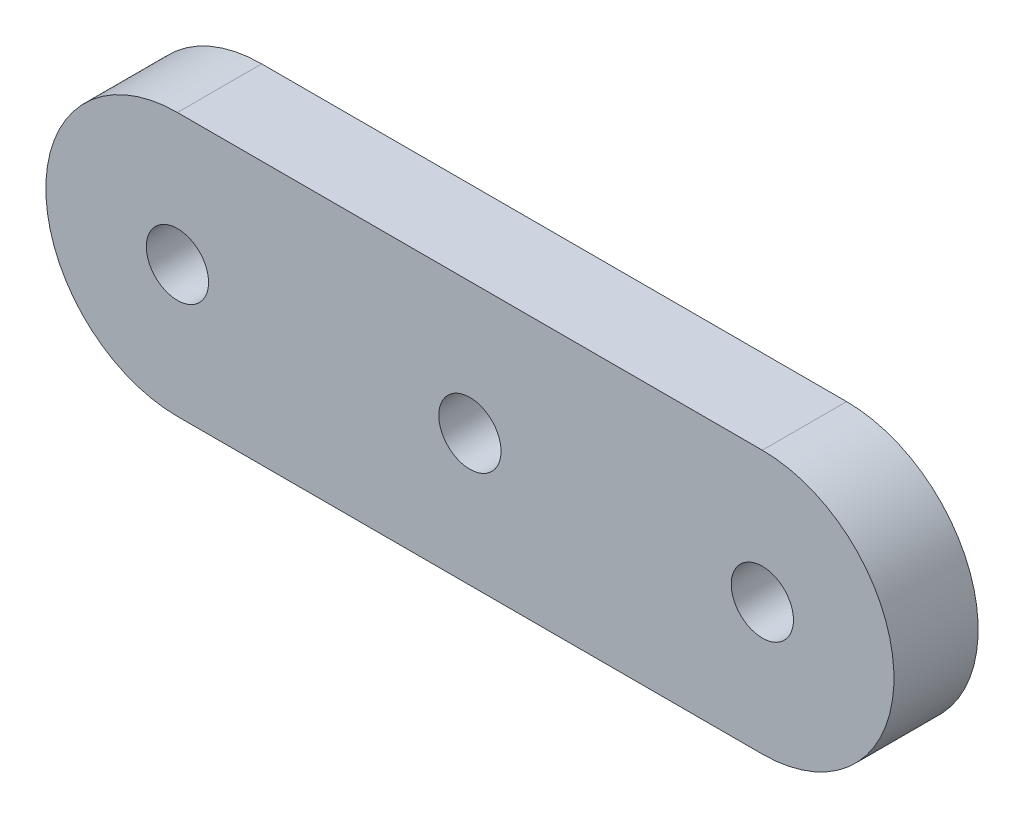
ISO-10303-21;
HEADER;
FILE_DESCRIPTION(('STEP AP214'),'2;1');
FILE_NAME('part.step','',(''),(''),'','','');
FILE_SCHEMA(('AUTOMOTIVE_DESIGN { 1 0 10303 214 1 1 1 1 }'));
ENDSEC;
DATA;
#1=APPLICATION_CONTEXT('core data for automotive mechanical design processes');
#2=APPLICATION_PROTOCOL_DEFINITION('international standard','automotive_design',2000,#1);
#3=PRODUCT_CONTEXT('',#1,'mechanical');
#4=PRODUCT('Part','Part','',(#3));
#5=PRODUCT_RELATED_PRODUCT_CATEGORY('part','',(#4));
#6=PRODUCT_DEFINITION_FORMATION('','',#4);
#7=PRODUCT_DEFINITION_CONTEXT('part definition',#1,'design');
#8=PRODUCT_DEFINITION('design','',#6,#7);
#9=PRODUCT_DEFINITION_SHAPE('','',#8);
#10=(LENGTH_UNIT() NAMED_UNIT(*) SI_UNIT(.MILLI.,.METRE.));
#11=(NAMED_UNIT(*) PLANE_ANGLE_UNIT() SI_UNIT($,.RADIAN.));
#12=(NAMED_UNIT(*) SI_UNIT($,.STERADIAN.) SOLID_ANGLE_UNIT());
#13=UNCERTAINTY_MEASURE_WITH_UNIT(LENGTH_MEASURE(1.E-05),#10,'distance_accuracy_value','');
#14=(GEOMETRIC_REPRESENTATION_CONTEXT(3) GLOBAL_UNCERTAINTY_ASSIGNED_CONTEXT((#13)) GLOBAL_UNIT_ASSIGNED_CONTEXT((#10,
#11,#12)) REPRESENTATION_CONTEXT('',''));
#15=CARTESIAN_POINT('',(0.,0.,0.));
#16=DIRECTION('',(0.,0.,1.));
#17=DIRECTION('',(1.,0.,0.));
#18=AXIS2_PLACEMENT_3D('',#15,#16,#17);
#19=CARTESIAN_POINT('',(-15.875,0.,4.572));
#20=DIRECTION('',(0.,0.,1.));
#21=DIRECTION('',(1.,0.,0.));
#22=AXIS2_PLACEMENT_3D('',#19,#20,#21);
#23=PLANE('',#22);
#24=CARTESIAN_POINT('',(15.875,0.,4.572));
#25=DIRECTION('',(0.,0.,1.));
#26=DIRECTION('',(1.,0.,0.));
#27=AXIS2_PLACEMENT_3D('',#24,#25,#26);
#28=CIRCLE('',#27,3.3782);
#29=CARTESIAN_POINT('',(19.2532,0.,4.572));
#30=VERTEX_POINT('',#29);
#31=EDGE_CURVE('E86',#30,#30,#28,.T.);
#32=ORIENTED_EDGE('',*,*,#31,.F.);
#33=EDGE_LOOP('',(#32));
#34=FACE_BOUND('',#33,.T.);
#35=CARTESIAN_POINT('',(-15.875,0.,4.572));
#36=DIRECTION('',(0.,0.,1.));
#37=DIRECTION('',(1.,0.,0.));
#38=AXIS2_PLACEMENT_3D('',#35,#36,#37);
#39=CIRCLE('',#38,3.3782);
#40=CARTESIAN_POINT('',(-12.4968,0.,4.572));
#41=VERTEX_POINT('',#40);
#42=EDGE_CURVE('E90',#41,#41,#39,.T.);
#43=ORIENTED_EDGE('',*,*,#42,.F.);
#44=EDGE_LOOP('',(#43));
#45=FACE_BOUND('',#44,.T.);
#46=CARTESIAN_POINT('',(-15.875,0.,4.572));
#47=DIRECTION('',(0.,0.,1.));
#48=DIRECTION('',(1.,0.,0.));
#49=AXIS2_PLACEMENT_3D('',#46,#47,#48);
#50=CIRCLE('',#49,14.2875);
#51=CARTESIAN_POINT('',(-15.875,14.2875,4.572));
#52=VERTEX_POINT('',#51);
#53=CARTESIAN_POINT('',(-15.875,-14.2875,4.572));
#54=VERTEX_POINT('',#53);
#55=EDGE_CURVE('E59',#52,#54,#50,.T.);
#56=ORIENTED_EDGE('',*,*,#55,.T.);
#57=DIRECTION('',(1.,0.,0.));
#58=VECTOR('',#57,1.);
#59=CARTESIAN_POINT('',(-15.875,-14.2875,4.572));
#60=LINE('',#59,#58);
#61=CARTESIAN_POINT('',(47.625,-14.2875,4.572));
#62=VERTEX_POINT('',#61);
#63=EDGE_CURVE('E53',#54,#62,#60,.T.);
#64=ORIENTED_EDGE('',*,*,#63,.T.);
#65=CARTESIAN_POINT('',(47.625,0.,4.572));
#66=DIRECTION('',(0.,0.,1.));
#67=DIRECTION('',(-1.,0.,0.));
#68=AXIS2_PLACEMENT_3D('',#65,#66,#67);
#69=CIRCLE('',#68,14.2875);
#70=CARTESIAN_POINT('',(47.625,14.2875,4.572));
#71=VERTEX_POINT('',#70);
#72=EDGE_CURVE('E57',#62,#71,#69,.T.);
#73=ORIENTED_EDGE('',*,*,#72,.T.);
#74=DIRECTION('',(-1.,0.,0.));
#75=VECTOR('',#74,1.);
#76=CARTESIAN_POINT('',(15.875,14.2875,4.572));
#77=LINE('',#76,#75);
#78=EDGE_CURVE('E33',#71,#52,#77,.T.);
#79=ORIENTED_EDGE('',*,*,#78,.T.);
#80=EDGE_LOOP('',(#56,#64,#73,#79));
#81=FACE_BOUND('',#80,.T.);
#82=CARTESIAN_POINT('',(47.625,0.,4.572));
#83=DIRECTION('',(0.,0.,1.));
#84=DIRECTION('',(-1.,0.,0.));
#85=AXIS2_PLACEMENT_3D('',#82,#83,#84);
#86=CIRCLE('',#85,3.3782);
#87=CARTESIAN_POINT('',(51.0032,0.,4.57200000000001));
#88=VERTEX_POINT('',#87);
#89=EDGE_CURVE('E75',#88,#88,#86,.T.);
#90=ORIENTED_EDGE('',*,*,#89,.F.);
#91=EDGE_LOOP('',(#90));
#92=FACE_BOUND('',#91,.T.);
#93=ADVANCED_FACE('F16',(#34,#45,#81,#92),#23,.T.);
#94=CARTESIAN_POINT('',(-15.875,0.,-4.572));
#95=DIRECTION('',(0.,0.,1.));
#96=DIRECTION('',(1.,0.,0.));
#97=AXIS2_PLACEMENT_3D('',#94,#95,#96);
#98=PLANE('',#97);
#99=CARTESIAN_POINT('',(15.875,0.,-4.572));
#100=DIRECTION('',(0.,0.,1.));
#101=DIRECTION('',(1.,0.,0.));
#102=AXIS2_PLACEMENT_3D('',#99,#100,#101);
#103=CIRCLE('',#102,3.3782);
#104=CARTESIAN_POINT('',(19.2532,0.,-4.572));
#105=VERTEX_POINT('',#104);
#106=EDGE_CURVE('E20',#105,#105,#103,.T.);
#107=ORIENTED_EDGE('',*,*,#106,.T.);
#108=EDGE_LOOP('',(#107));
#109=FACE_BOUND('',#108,.T.);
#110=CARTESIAN_POINT('',(-15.875,0.,-4.572));
#111=DIRECTION('',(0.,0.,1.));
#112=DIRECTION('',(1.,0.,0.));
#113=AXIS2_PLACEMENT_3D('',#110,#111,#112);
#114=CIRCLE('',#113,3.3782);
#115=CARTESIAN_POINT('',(-12.4968,0.,-4.572));
#116=VERTEX_POINT('',#115);
#117=EDGE_CURVE('E89',#116,#116,#114,.T.);
#118=ORIENTED_EDGE('',*,*,#117,.T.);
#119=EDGE_LOOP('',(#118));
#120=FACE_BOUND('',#119,.T.);
#121=CARTESIAN_POINT('',(-15.875,0.,-4.572));
#122=DIRECTION('',(0.,0.,1.));
#123=DIRECTION('',(1.,0.,0.));
#124=AXIS2_PLACEMENT_3D('',#121,#122,#123);
#125=CIRCLE('',#124,14.2875);
#126=CARTESIAN_POINT('',(-15.875,14.2875,-4.572));
#127=VERTEX_POINT('',#126);
#128=CARTESIAN_POINT('',(-15.875,-14.2875,-4.572));
#129=VERTEX_POINT('',#128);
#130=EDGE_CURVE('E92',#127,#129,#125,.T.);
#131=ORIENTED_EDGE('',*,*,#130,.F.);
#132=DIRECTION('',(-1.,0.,0.));
#133=VECTOR('',#132,1.);
#134=CARTESIAN_POINT('',(15.875,14.2875,-4.572));
#135=LINE('',#134,#133);
#136=CARTESIAN_POINT('',(47.625,14.2875,-4.57199999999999));
#137=VERTEX_POINT('',#136);
#138=EDGE_CURVE('E97',#137,#127,#135,.T.);
#139=ORIENTED_EDGE('',*,*,#138,.F.);
#140=CARTESIAN_POINT('',(47.625,0.,-4.57199999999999));
#141=DIRECTION('',(0.,0.,1.));
#142=DIRECTION('',(1.,0.,0.));
#143=AXIS2_PLACEMENT_3D('',#140,#141,#142);
#144=CIRCLE('',#143,14.2875);
#145=CARTESIAN_POINT('',(47.625,-14.2875,-4.57200000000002));
#146=VERTEX_POINT('',#145);
#147=EDGE_CURVE('E81',#137,#146,#144,.F.);
#148=ORIENTED_EDGE('',*,*,#147,.T.);
#149=DIRECTION('',(1.,0.,0.));
#150=VECTOR('',#149,1.);
#151=CARTESIAN_POINT('',(-15.875,-14.2875,-4.572));
#152=LINE('',#151,#150);
#153=EDGE_CURVE('E66',#129,#146,#152,.T.);
#154=ORIENTED_EDGE('',*,*,#153,.F.);
#155=EDGE_LOOP('',(#131,#139,#148,#154));
#156=FACE_BOUND('',#155,.T.);
#157=CARTESIAN_POINT('',(47.625,0.,-4.57199999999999));
#158=DIRECTION('',(0.,0.,1.));
#159=DIRECTION('',(1.,0.,0.));
#160=AXIS2_PLACEMENT_3D('',#157,#158,#159);
#161=CIRCLE('',#160,3.3782);
#162=CARTESIAN_POINT('',(51.0032,0.,-4.57200000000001));
#163=VERTEX_POINT('',#162);
#164=EDGE_CURVE('E83',#163,#163,#161,.F.);
#165=ORIENTED_EDGE('',*,*,#164,.F.);
#166=EDGE_LOOP('',(#165));
#167=FACE_BOUND('',#166,.T.);
#168=ADVANCED_FACE('F105',(#109,#120,#156,#167),#98,.F.);
#169=CARTESIAN_POINT('',(-15.875,0.,4.572));
#170=DIRECTION('',(0.,0.,-1.));
#171=DIRECTION('',(-1.,0.,0.));
#172=AXIS2_PLACEMENT_3D('',#169,#170,#171);
#173=CYLINDRICAL_SURFACE('',#172,14.2875);
#174=ORIENTED_EDGE('',*,*,#130,.T.);
#175=DIRECTION('',(0.,0.,1.));
#176=VECTOR('',#175,1.);
#177=CARTESIAN_POINT('',(-15.875,-14.2875,4.572));
#178=LINE('',#177,#176);
#179=EDGE_CURVE('E11',#54,#129,#178,.F.);
#180=ORIENTED_EDGE('',*,*,#179,.F.);
#181=ORIENTED_EDGE('',*,*,#55,.F.);
#182=DIRECTION('',(0.,0.,-1.));
#183=VECTOR('',#182,1.);
#184=CARTESIAN_POINT('',(-15.875,14.2875,4.572));
#185=LINE('',#184,#183);
#186=EDGE_CURVE('E26',#52,#127,#185,.T.);
#187=ORIENTED_EDGE('',*,*,#186,.T.);
#188=EDGE_LOOP('',(#174,#180,#181,#187));
#189=FACE_BOUND('',#188,.T.);
#190=ADVANCED_FACE('F127',(#189),#173,.T.);
#191=CARTESIAN_POINT('',(-15.875,-14.2875,4.572));
#192=DIRECTION('',(0.,1.,0.));
#193=DIRECTION('',(0.,0.,1.));
#194=AXIS2_PLACEMENT_3D('',#191,#192,#193);
#195=PLANE('',#194);
#196=ORIENTED_EDGE('',*,*,#153,.T.);
#197=DIRECTION('',(0.,0.,1.));
#198=VECTOR('',#197,1.);
#199=CARTESIAN_POINT('',(47.625,-14.2875,-100.979137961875));
#200=LINE('',#199,#198);
#201=EDGE_CURVE('E64',#146,#62,#200,.T.);
#202=ORIENTED_EDGE('',*,*,#201,.T.);
#203=ORIENTED_EDGE('',*,*,#63,.F.);
#204=ORIENTED_EDGE('',*,*,#179,.T.);
#205=EDGE_LOOP('',(#196,#202,#203,#204));
#206=FACE_BOUND('',#205,.T.);
#207=ADVANCED_FACE('F65',(#206),#195,.F.);
#208=CARTESIAN_POINT('',(15.875,14.2875,4.572));
#209=DIRECTION('',(0.,-1.,0.));
#210=DIRECTION('',(0.,0.,-1.));
#211=AXIS2_PLACEMENT_3D('',#208,#209,#210);
#212=PLANE('',#211);
#213=ORIENTED_EDGE('',*,*,#138,.T.);
#214=ORIENTED_EDGE('',*,*,#186,.F.);
#215=ORIENTED_EDGE('',*,*,#78,.F.);
#216=DIRECTION('',(0.,0.,1.));
#217=VECTOR('',#216,1.);
#218=CARTESIAN_POINT('',(47.625,14.2875,-100.979137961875));
#219=LINE('',#218,#217);
#220=EDGE_CURVE('E70',#137,#71,#219,.T.);
#221=ORIENTED_EDGE('',*,*,#220,.F.);
#222=EDGE_LOOP('',(#213,#214,#215,#221));
#223=FACE_BOUND('',#222,.T.);
#224=ADVANCED_FACE('F18',(#223),#212,.F.);
#225=CARTESIAN_POINT('',(-15.875,0.,-8.128));
#226=DIRECTION('',(0.,0.,1.));
#227=DIRECTION('',(1.,0.,0.));
#228=AXIS2_PLACEMENT_3D('',#225,#226,#227);
#229=CYLINDRICAL_SURFACE('',#228,3.3782);
#230=ORIENTED_EDGE('',*,*,#42,.T.);
#231=EDGE_LOOP('',(#230));
#232=FACE_BOUND('',#231,.T.);
#233=ORIENTED_EDGE('',*,*,#117,.F.);
#234=EDGE_LOOP('',(#233));
#235=FACE_BOUND('',#234,.T.);
#236=ADVANCED_FACE('F108',(#232,#235),#229,.F.);
#237=CARTESIAN_POINT('',(15.875,0.,-8.128));
#238=DIRECTION('',(0.,0.,1.));
#239=DIRECTION('',(1.,0.,0.));
#240=AXIS2_PLACEMENT_3D('',#237,#238,#239);
#241=CYLINDRICAL_SURFACE('',#240,3.3782);
#242=ORIENTED_EDGE('',*,*,#31,.T.);
#243=EDGE_LOOP('',(#242));
#244=FACE_BOUND('',#243,.T.);
#245=ORIENTED_EDGE('',*,*,#106,.F.);
#246=EDGE_LOOP('',(#245));
#247=FACE_BOUND('',#246,.T.);
#248=ADVANCED_FACE('F110',(#244,#247),#241,.F.);
#249=CARTESIAN_POINT('',(47.625,0.,-100.979137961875));
#250=DIRECTION('',(0.,0.,1.));
#251=DIRECTION('',(1.,0.,0.));
#252=AXIS2_PLACEMENT_3D('',#249,#250,#251);
#253=CYLINDRICAL_SURFACE('',#252,14.2875);
#254=ORIENTED_EDGE('',*,*,#147,.F.);
#255=ORIENTED_EDGE('',*,*,#220,.T.);
#256=ORIENTED_EDGE('',*,*,#72,.F.);
#257=ORIENTED_EDGE('',*,*,#201,.F.);
#258=EDGE_LOOP('',(#254,#255,#256,#257));
#259=FACE_BOUND('',#258,.T.);
#260=ADVANCED_FACE('F73',(#259),#253,.T.);
#261=CARTESIAN_POINT('',(47.625,0.,-100.979137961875));
#262=DIRECTION('',(0.,0.,1.));
#263=DIRECTION('',(1.,0.,0.));
#264=AXIS2_PLACEMENT_3D('',#261,#262,#263);
#265=CYLINDRICAL_SURFACE('',#264,3.3782);
#266=CARTESIAN_POINT('',(51.0032,0.,-4.57200000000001));
#267=CARTESIAN_POINT('',(51.0032,0.,-4.47675000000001));
#268=CARTESIAN_POINT('',(51.0032,0.,-4.38150000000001));
#269=CARTESIAN_POINT('',(51.0032,0.,-4.191));
#270=CARTESIAN_POINT('',(51.0032,0.,-4.09575000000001));
#271=CARTESIAN_POINT('',(51.0032,0.,-3.90525));
#272=CARTESIAN_POINT('',(51.0032,0.,-3.81));
#273=CARTESIAN_POINT('',(51.0032,0.,-3.6195));
#274=CARTESIAN_POINT('',(51.0032,0.,-3.52425));
#275=CARTESIAN_POINT('',(51.0032,0.,-3.33375));
#276=CARTESIAN_POINT('',(51.0032,0.,-3.2385));
#277=CARTESIAN_POINT('',(51.0032,0.,-3.048));
#278=CARTESIAN_POINT('',(51.0032,0.,-2.95275));
#279=CARTESIAN_POINT('',(51.0032,0.,-2.76225));
#280=CARTESIAN_POINT('',(51.0032,0.,-2.667));
#281=CARTESIAN_POINT('',(51.0032,0.,-2.4765));
#282=CARTESIAN_POINT('',(51.0032,0.,-2.38125));
#283=CARTESIAN_POINT('',(51.0032,0.,-2.19075));
#284=CARTESIAN_POINT('',(51.0032,0.,-2.0955));
#285=CARTESIAN_POINT('',(51.0032,0.,-1.90500000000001));
#286=CARTESIAN_POINT('',(51.0032,0.,-1.80975000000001));
#287=CARTESIAN_POINT('',(51.0032,0.,-1.61925000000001));
#288=CARTESIAN_POINT('',(51.0032,0.,-1.52400000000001));
#289=CARTESIAN_POINT('',(51.0032,0.,-1.33350000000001));
#290=CARTESIAN_POINT('',(51.0032,0.,-1.23825000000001));
#291=CARTESIAN_POINT('',(51.0032,0.,-1.04775));
#292=CARTESIAN_POINT('',(51.0032,0.,-0.952500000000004));
#293=CARTESIAN_POINT('',(51.0032,0.,-0.762000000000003));
#294=CARTESIAN_POINT('',(51.0032,0.,-0.666750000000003));
#295=CARTESIAN_POINT('',(51.0032,0.,-0.476250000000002));
#296=CARTESIAN_POINT('',(51.0032,0.,-0.381000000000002));
#297=CARTESIAN_POINT('',(51.0032,0.,-0.190500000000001));
#298=CARTESIAN_POINT('',(51.0032,0.,-0.0952500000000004));
#299=CARTESIAN_POINT('',(51.0032,0.,0.0952500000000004));
#300=CARTESIAN_POINT('',(51.0032,0.,0.190500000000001));
#301=CARTESIAN_POINT('',(51.0032,0.,0.381000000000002));
#302=CARTESIAN_POINT('',(51.0032,0.,0.476250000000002));
#303=CARTESIAN_POINT('',(51.0032,0.,0.666750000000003));
#304=CARTESIAN_POINT('',(51.0032,0.,0.762000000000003));
#305=CARTESIAN_POINT('',(51.0032,0.,0.952500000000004));
#306=CARTESIAN_POINT('',(51.0032,0.,1.04775));
#307=CARTESIAN_POINT('',(51.0032,0.,1.23825000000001));
#308=CARTESIAN_POINT('',(51.0032,0.,1.33350000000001));
#309=CARTESIAN_POINT('',(51.0032,0.,1.52400000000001));
#310=CARTESIAN_POINT('',(51.0032,0.,1.61925000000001));
#311=CARTESIAN_POINT('',(51.0032,0.,1.80975000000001));
#312=CARTESIAN_POINT('',(51.0032,0.,1.90500000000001));
#313=CARTESIAN_POINT('',(51.0032,0.,2.0955));
#314=CARTESIAN_POINT('',(51.0032,0.,2.19075));
#315=CARTESIAN_POINT('',(51.0032,0.,2.38125));
#316=CARTESIAN_POINT('',(51.0032,0.,2.4765));
#317=CARTESIAN_POINT('',(51.0032,0.,2.667));
#318=CARTESIAN_POINT('',(51.0032,0.,2.76225));
#319=CARTESIAN_POINT('',(51.0032,0.,2.95275));
#320=CARTESIAN_POINT('',(51.0032,0.,3.048));
#321=CARTESIAN_POINT('',(51.0032,0.,3.2385));
#322=CARTESIAN_POINT('',(51.0032,0.,3.33375));
#323=CARTESIAN_POINT('',(51.0032,0.,3.52425));
#324=CARTESIAN_POINT('',(51.0032,0.,3.6195));
#325=CARTESIAN_POINT('',(51.0032,0.,3.81));
#326=CARTESIAN_POINT('',(51.0032,0.,3.90525));
#327=CARTESIAN_POINT('',(51.0032,0.,4.09575000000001));
#328=CARTESIAN_POINT('',(51.0032,0.,4.191));
#329=CARTESIAN_POINT('',(51.0032,0.,4.38150000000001));
#330=CARTESIAN_POINT('',(51.0032,0.,4.47675000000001));
#331=CARTESIAN_POINT('',(51.0032,0.,4.57200000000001));
#332=B_SPLINE_CURVE_WITH_KNOTS('',3,(#266,#267,#268,#269,#270,#271,#272,#273,#274,#275,#276,
#277,#278,#279,#280,#281,#282,#283,#284,#285,#286,#287,#288,#289,#290,#291,#292,#293,#294,#295,
#296,#297,#298,#299,#300,#301,#302,#303,#304,#305,#306,#307,#308,#309,#310,#311,#312,#313,#314,
#315,#316,#317,#318,#319,#320,#321,#322,#323,#324,#325,#326,#327,#328,#329,#330,#331),
.UNSPECIFIED.,.F.,.F.,(4,2,2,2,2,2,2,2,2,2,2,2,2,2,2,2,2,2,2,2,2,2,2,2,2,2,2,2,2,2,2,2,4),(0.,
0.285750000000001,0.571500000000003,0.857250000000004,1.14300000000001,1.42875000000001,
1.71450000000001,2.00025000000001,2.28600000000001,2.57175,2.8575,3.14325,3.429,3.71475,4.0005,
4.28625000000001,4.57200000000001,4.85775000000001,5.14350000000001,5.42925000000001,
5.71500000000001,6.00075000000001,6.28650000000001,6.57225000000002,6.858,7.14375,
7.42950000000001,7.71525000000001,8.00100000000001,8.28675000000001,8.57250000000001,
8.85825000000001,9.14400000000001),.UNSPECIFIED.);
#333=EDGE_CURVE('BSEAM142',#163,#88,#332,.T.);
#334=ORIENTED_EDGE('',*,*,#164,.T.);
#335=ORIENTED_EDGE('',*,*,#89,.T.);
#336=ORIENTED_EDGE('',*,*,#333,.T.);
#337=ORIENTED_EDGE('',*,*,#333,.F.);
#338=EDGE_LOOP('',(#334,#336,#335,#337));
#339=FACE_BOUND('',#338,.T.);
#340=ADVANCED_FACE('F142',(#339),#265,.F.);
#341=CLOSED_SHELL('',(#93,#168,#190,#207,#224,#236,#248,#260,#340));
#342=MANIFOLD_SOLID_BREP('B1',#341);
#343=ADVANCED_BREP_SHAPE_REPRESENTATION('',(#18,#342),#14);
#344=SHAPE_DEFINITION_REPRESENTATION(#9,#343);
ENDSEC;
END-ISO-10303-21;
